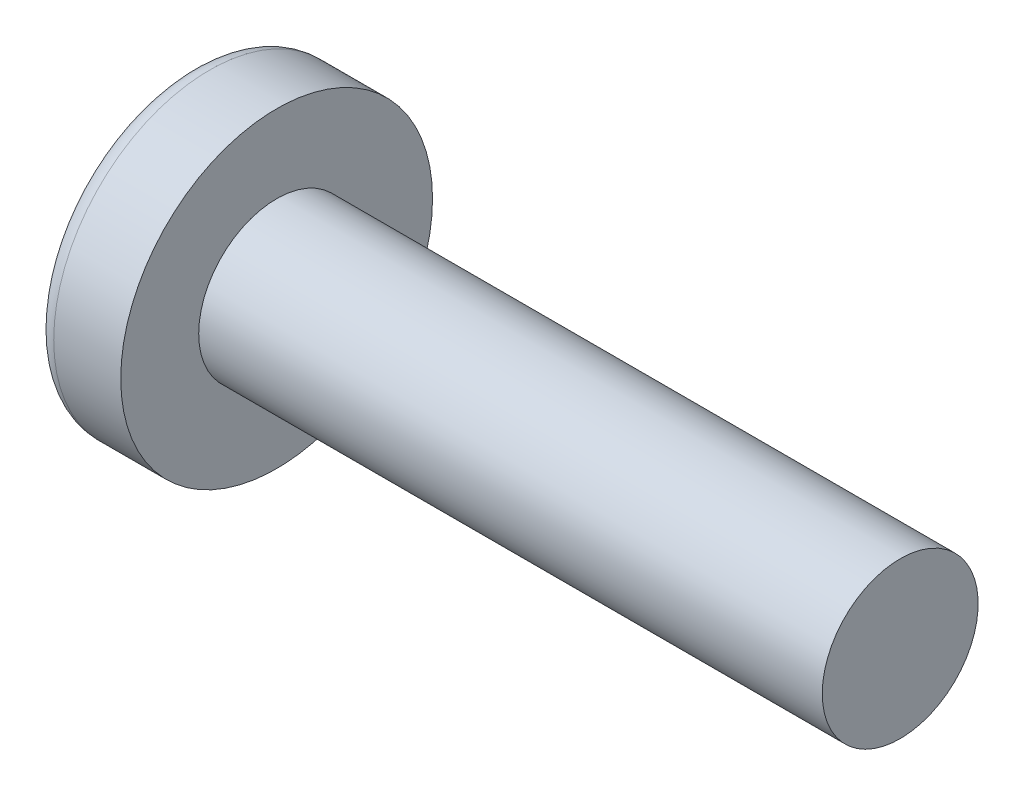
from build123d import *

# Parameters (mm, degrees)
CIRPATTERN1_COUNT = 2
CIRPATTERN1_ANGLE = 90


with BuildPart() as part:
    # BodySke → Base-Revolve (revolve)
    with BuildSketch(Plane.XY, mode=Mode.PRIVATE) as base_revolve_sk:
        with BuildLine():
            Line((2.1, 1.25), (2.1, 2.5))
            Line((2.1, 2.5), (1.025105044, 2.5))
            ThreePointArc((1.025105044, 2.5), (0.890037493, 2.467874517), (0.783897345, 2.378378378))
            ThreePointArc((0.783897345, 2.378378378), (0.201025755, 1.252116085), (0, 0))
            Line((0, 0), (12.1, 0))
            Line((12.1, 0), (12.1, 1.25))
            Line((12.1, 1.25), (2.1, 1.25))
        make_face()
    revolve(base_revolve_sk.sketch.rotate(Axis((-25.4, 0, 0), (1, 0, 0)), 90), axis=Axis((-25.4, 0, 0), (1, 0, 0)))

    # Sketch3 → Cut-Loft1 section 0
    with BuildSketch(Plane(origin=(0, 0, 0), x_dir=(0, 0, -1), z_dir=(1, 0, 0))):
        with BuildLine():
            Line((0.35, -1.34), (-0.35, -1.34))
            Line((-0.35, -1.34), (-0.35, 1.34))
            Line((-0.35, 1.34), (0.35, 1.34))
            Line((0.35, 1.34), (0.35, -1.34))
        make_face()
    # Sketch4 → Cut-Loft1 section 1
    with BuildSketch(Plane(origin=(1.53, 0, 0), x_dir=(0, 0, -1), z_dir=(1, 0, 0))):
        with BuildLine():
            Line((0.175, -0.175), (-0.175, -0.175))
            Line((-0.175, -0.175), (-0.175, 0.175))
            Line((-0.175, 0.175), (0.175, 0.175))
            Line((0.175, 0.175), (0.175, -0.175))
        make_face()
    cut_loft1 = loft(mode=Mode.SUBTRACT)

    # CirPattern1: Cut-Loft1 ×2 about axis
    cirpattern1_axis = Axis((-25.4, 0, 0), (1, 0, 0))
    for i in range(1, CIRPATTERN1_COUNT):
        add(cut_loft1.rotate(cirpattern1_axis, i * CIRPATTERN1_ANGLE / (CIRPATTERN1_COUNT - 1)), mode=Mode.SUBTRACT)


solid = part.part
